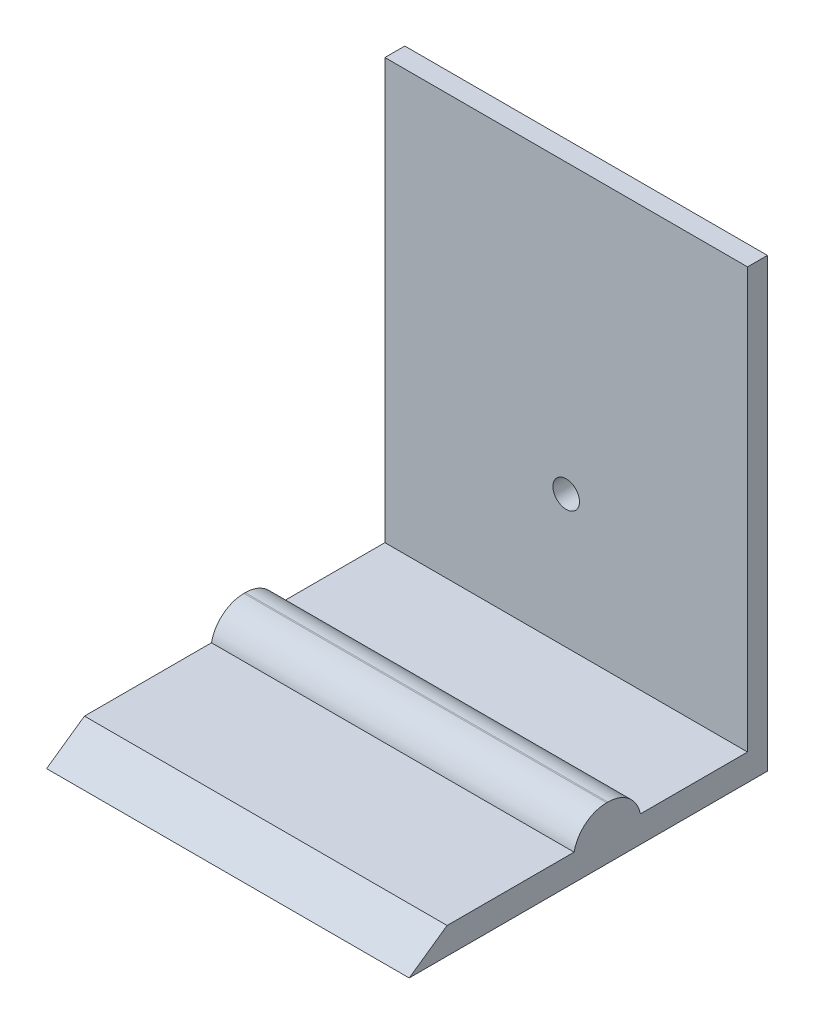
ISO-10303-21;
HEADER;
FILE_DESCRIPTION(('STEP AP214'),'2;1');
FILE_NAME('part.step','',(''),(''),'','','');
FILE_SCHEMA(('AUTOMOTIVE_DESIGN { 1 0 10303 214 1 1 1 1 }'));
ENDSEC;
DATA;
#1=APPLICATION_CONTEXT('core data for automotive mechanical design processes');
#2=APPLICATION_PROTOCOL_DEFINITION('international standard','automotive_design',2000,#1);
#3=PRODUCT_CONTEXT('',#1,'mechanical');
#4=PRODUCT('Part','Part','',(#3));
#5=PRODUCT_RELATED_PRODUCT_CATEGORY('part','',(#4));
#6=PRODUCT_DEFINITION_FORMATION('','',#4);
#7=PRODUCT_DEFINITION_CONTEXT('part definition',#1,'design');
#8=PRODUCT_DEFINITION('design','',#6,#7);
#9=PRODUCT_DEFINITION_SHAPE('','',#8);
#10=(LENGTH_UNIT() NAMED_UNIT(*) SI_UNIT(.MILLI.,.METRE.));
#11=(NAMED_UNIT(*) PLANE_ANGLE_UNIT() SI_UNIT($,.RADIAN.));
#12=(NAMED_UNIT(*) SI_UNIT($,.STERADIAN.) SOLID_ANGLE_UNIT());
#13=UNCERTAINTY_MEASURE_WITH_UNIT(LENGTH_MEASURE(1.E-05),#10,'distance_accuracy_value','');
#14=(GEOMETRIC_REPRESENTATION_CONTEXT(3) GLOBAL_UNCERTAINTY_ASSIGNED_CONTEXT((#13)) GLOBAL_UNIT_ASSIGNED_CONTEXT((#10,
#11,#12)) REPRESENTATION_CONTEXT('',''));
#15=CARTESIAN_POINT('',(0.,0.,0.));
#16=DIRECTION('',(0.,0.,1.));
#17=DIRECTION('',(1.,0.,0.));
#18=AXIS2_PLACEMENT_3D('',#15,#16,#17);
#19=CARTESIAN_POINT('',(-169.999999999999,51.,210.000000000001));
#20=DIRECTION('',(0.,-1.,0.));
#21=DIRECTION('',(0.,0.,1.));
#22=AXIS2_PLACEMENT_3D('',#19,#20,#21);
#23=PLANE('',#22);
#24=DIRECTION('',(-1.,0.,0.));
#25=VECTOR('',#24,1.);
#26=CARTESIAN_POINT('',(-44.0000000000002,51.,68.9999999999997));
#27=LINE('',#26,#25);
#28=CARTESIAN_POINT('',(-80.5000000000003,51.,68.9999999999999));
#29=VERTEX_POINT('',#28);
#30=CARTESIAN_POINT('',(-89.5000000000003,51.,69.));
#31=VERTEX_POINT('',#30);
#32=EDGE_CURVE('E11',#29,#31,#27,.T.);
#33=ORIENTED_EDGE('',*,*,#32,.F.);
#34=DIRECTION('',(0.,0.,1.));
#35=VECTOR('',#34,1.);
#36=CARTESIAN_POINT('',(-80.5000000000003,51.,59.9999999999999));
#37=LINE('',#36,#35);
#38=CARTESIAN_POINT('',(-80.5000000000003,51.,59.9999999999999));
#39=VERTEX_POINT('',#38);
#40=EDGE_CURVE('E137',#39,#29,#37,.T.);
#41=ORIENTED_EDGE('',*,*,#40,.F.);
#42=DIRECTION('',(1.,0.,0.));
#43=VECTOR('',#42,1.);
#44=CARTESIAN_POINT('',(-170.,51.,60.0000000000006));
#45=LINE('',#44,#43);
#46=CARTESIAN_POINT('',(-89.5000000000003,51.,60.));
#47=VERTEX_POINT('',#46);
#48=EDGE_CURVE('E71',#47,#39,#45,.T.);
#49=ORIENTED_EDGE('',*,*,#48,.F.);
#50=DIRECTION('',(0.,0.,1.));
#51=VECTOR('',#50,1.);
#52=CARTESIAN_POINT('',(-89.4999999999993,51.,210.));
#53=LINE('',#52,#51);
#54=EDGE_CURVE('E140',#47,#31,#53,.T.);
#55=ORIENTED_EDGE('',*,*,#54,.T.);
#56=EDGE_LOOP('',(#33,#41,#49,#55));
#57=FACE_BOUND('',#56,.T.);
#58=ADVANCED_FACE('F36',(#57),#23,.F.);
#59=CARTESIAN_POINT('',(-169.999999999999,15.,210.000000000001));
#60=DIRECTION('',(0.,1.,0.));
#61=DIRECTION('',(0.,0.,-1.));
#62=AXIS2_PLACEMENT_3D('',#59,#60,#61);
#63=PLANE('',#62);
#64=DIRECTION('',(0.,0.,-1.));
#65=VECTOR('',#64,1.);
#66=CARTESIAN_POINT('',(-43.9999999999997,15.,150.));
#67=LINE('',#66,#65);
#68=CARTESIAN_POINT('',(-44.,15.,97.7155559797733));
#69=VERTEX_POINT('',#68);
#70=CARTESIAN_POINT('',(-44.0000000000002,15.,73.4999999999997));
#71=VERTEX_POINT('',#70);
#72=EDGE_CURVE('E131',#69,#71,#67,.T.);
#73=ORIENTED_EDGE('',*,*,#72,.T.);
#74=DIRECTION('',(1.,0.,0.));
#75=VECTOR('',#74,1.);
#76=CARTESIAN_POINT('',(-44.0000000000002,15.,73.4999999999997));
#77=LINE('',#76,#75);
#78=CARTESIAN_POINT('',(-126.,15.,73.5000000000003));
#79=VERTEX_POINT('',#78);
#80=EDGE_CURVE('E214',#79,#71,#77,.T.);
#81=ORIENTED_EDGE('',*,*,#80,.F.);
#82=DIRECTION('',(0.,0.,1.));
#83=VECTOR('',#82,1.);
#84=CARTESIAN_POINT('',(-126.,15.,150.));
#85=LINE('',#84,#83);
#86=CARTESIAN_POINT('',(-126.,15.,97.7155559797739));
#87=VERTEX_POINT('',#86);
#88=EDGE_CURVE('E80',#79,#87,#85,.T.);
#89=ORIENTED_EDGE('',*,*,#88,.T.);
#90=DIRECTION('',(-1.,0.,0.));
#91=VECTOR('',#90,1.);
#92=CARTESIAN_POINT('',(-44.,15.,97.7155559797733));
#93=LINE('',#92,#91);
#94=EDGE_CURVE('E198',#69,#87,#93,.T.);
#95=ORIENTED_EDGE('',*,*,#94,.F.);
#96=EDGE_LOOP('',(#73,#81,#89,#95));
#97=FACE_BOUND('',#96,.T.);
#98=ADVANCED_FACE('F289',(#97),#63,.T.);
#99=CARTESIAN_POINT('',(-43.9999999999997,15.,150.));
#100=DIRECTION('',(-1.,0.,0.));
#101=DIRECTION('',(0.,0.,1.));
#102=AXIS2_PLACEMENT_3D('',#99,#100,#101);
#103=PLANE('',#102);
#104=ORIENTED_EDGE('',*,*,#72,.F.);
#105=CARTESIAN_POINT('',(-44.,13.5,105.064025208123));
#106=DIRECTION('',(-1.,0.,0.));
#107=DIRECTION('',(0.,0.,1.));
#108=AXIS2_PLACEMENT_3D('',#105,#106,#107);
#109=CIRCLE('',#108,7.5);
#110=CARTESIAN_POINT('',(-44.,21.,105.064025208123));
#111=VERTEX_POINT('',#110);
#112=EDGE_CURVE('E45',#69,#111,#109,.F.);
#113=ORIENTED_EDGE('',*,*,#112,.T.);
#114=DIRECTION('',(0.,0.,-1.));
#115=VECTOR('',#114,1.);
#116=CARTESIAN_POINT('',(-44.,21.,97.7155559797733));
#117=LINE('',#116,#115);
#118=CARTESIAN_POINT('',(-44.,21.,105.367086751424));
#119=VERTEX_POINT('',#118);
#120=EDGE_CURVE('E192',#119,#111,#117,.T.);
#121=ORIENTED_EDGE('',*,*,#120,.F.);
#122=CARTESIAN_POINT('',(-44.,13.5,105.367086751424));
#123=DIRECTION('',(-1.,0.,0.));
#124=DIRECTION('',(0.,0.,1.));
#125=AXIS2_PLACEMENT_3D('',#122,#123,#124);
#126=CIRCLE('',#125,7.5);
#127=CARTESIAN_POINT('',(-43.9999999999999,15.,112.715555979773));
#128=VERTEX_POINT('',#127);
#129=EDGE_CURVE('E156',#119,#128,#126,.F.);
#130=ORIENTED_EDGE('',*,*,#129,.T.);
#131=CARTESIAN_POINT('',(-43.9999999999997,15.,141.431111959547));
#132=VERTEX_POINT('',#131);
#133=EDGE_CURVE('E195',#132,#128,#67,.T.);
#134=ORIENTED_EDGE('',*,*,#133,.F.);
#135=DIRECTION('',(0.,-0.573576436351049,0.81915204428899));
#136=VECTOR('',#135,1.);
#137=CARTESIAN_POINT('',(-43.9999999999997,15.,141.431111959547));
#138=LINE('',#137,#136);
#139=CARTESIAN_POINT('',(-43.9999999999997,9.00000000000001,150.));
#140=VERTEX_POINT('',#139);
#141=EDGE_CURVE('E171',#132,#140,#138,.T.);
#142=ORIENTED_EDGE('',*,*,#141,.T.);
#143=DIRECTION('',(0.,0.,-1.));
#144=VECTOR('',#143,1.);
#145=CARTESIAN_POINT('',(-43.9999999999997,9.00000000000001,150.));
#146=LINE('',#145,#144);
#147=CARTESIAN_POINT('',(-44.0000000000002,9.00000000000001,68.9999999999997));
#148=VERTEX_POINT('',#147);
#149=EDGE_CURVE('E189',#140,#148,#146,.T.);
#150=ORIENTED_EDGE('',*,*,#149,.T.);
#151=DIRECTION('',(0.,-1.,0.));
#152=VECTOR('',#151,1.);
#153=CARTESIAN_POINT('',(-44.0000000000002,15.,68.9999999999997));
#154=LINE('',#153,#152);
#155=CARTESIAN_POINT('',(-44.0000000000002,110.,68.9999999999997));
#156=VERTEX_POINT('',#155);
#157=EDGE_CURVE('E176',#156,#148,#154,.T.);
#158=ORIENTED_EDGE('',*,*,#157,.F.);
#159=DIRECTION('',(0.,0.,-1.));
#160=VECTOR('',#159,1.);
#161=CARTESIAN_POINT('',(-44.0000000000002,110.,73.4999999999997));
#162=LINE('',#161,#160);
#163=CARTESIAN_POINT('',(-44.0000000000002,110.,73.4999999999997));
#164=VERTEX_POINT('',#163);
#165=EDGE_CURVE('E237',#164,#156,#162,.T.);
#166=ORIENTED_EDGE('',*,*,#165,.F.);
#167=DIRECTION('',(0.,-1.,0.));
#168=VECTOR('',#167,1.);
#169=CARTESIAN_POINT('',(-44.0000000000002,45.,73.4999999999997));
#170=LINE('',#169,#168);
#171=EDGE_CURVE('E211',#164,#71,#170,.T.);
#172=ORIENTED_EDGE('',*,*,#171,.T.);
#173=EDGE_LOOP('',(#104,#113,#121,#130,#134,#142,#150,#158,#166,#172));
#174=FACE_BOUND('',#173,.T.);
#175=ADVANCED_FACE('F255',(#174),#103,.F.);
#176=CARTESIAN_POINT('',(-44.0000000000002,15.,68.9999999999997));
#177=DIRECTION('',(0.,0.,1.));
#178=DIRECTION('',(1.,0.,0.));
#179=AXIS2_PLACEMENT_3D('',#176,#177,#178);
#180=PLANE('',#179);
#181=DIRECTION('',(0.,-1.,0.));
#182=VECTOR('',#181,1.);
#183=CARTESIAN_POINT('',(-80.5000000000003,29.5,68.9999999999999));
#184=LINE('',#183,#182);
#185=CARTESIAN_POINT('',(-80.5000000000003,29.5,68.9999999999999));
#186=VERTEX_POINT('',#185);
#187=EDGE_CURVE('E142',#29,#186,#184,.T.);
#188=ORIENTED_EDGE('',*,*,#187,.F.);
#189=ORIENTED_EDGE('',*,*,#32,.T.);
#190=DIRECTION('',(0.,1.,0.));
#191=VECTOR('',#190,1.);
#192=CARTESIAN_POINT('',(-89.5000000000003,45.,69.));
#193=LINE('',#192,#191);
#194=CARTESIAN_POINT('',(-89.5000000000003,29.5,69.));
#195=VERTEX_POINT('',#194);
#196=EDGE_CURVE('E220',#195,#31,#193,.T.);
#197=ORIENTED_EDGE('',*,*,#196,.F.);
#198=CARTESIAN_POINT('',(-85.0000000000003,29.5,69.));
#199=DIRECTION('',(0.,0.,-1.));
#200=DIRECTION('',(-1.,0.,0.));
#201=AXIS2_PLACEMENT_3D('',#198,#199,#200);
#202=CIRCLE('',#201,4.5);
#203=EDGE_CURVE('E54',#186,#195,#202,.T.);
#204=ORIENTED_EDGE('',*,*,#203,.F.);
#205=EDGE_LOOP('',(#188,#189,#197,#204));
#206=FACE_BOUND('',#205,.T.);
#207=DIRECTION('',(-1.,0.,0.));
#208=VECTOR('',#207,1.);
#209=CARTESIAN_POINT('',(-44.0000000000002,110.,68.9999999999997));
#210=LINE('',#209,#208);
#211=CARTESIAN_POINT('',(-126.,110.,69.0000000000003));
#212=VERTEX_POINT('',#211);
#213=EDGE_CURVE('E234',#156,#212,#210,.T.);
#214=ORIENTED_EDGE('',*,*,#213,.F.);
#215=ORIENTED_EDGE('',*,*,#157,.T.);
#216=DIRECTION('',(-1.,0.,0.));
#217=VECTOR('',#216,1.);
#218=CARTESIAN_POINT('',(-44.0000000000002,9.00000000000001,68.9999999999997));
#219=LINE('',#218,#217);
#220=CARTESIAN_POINT('',(-126.,9.00000000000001,69.0000000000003));
#221=VERTEX_POINT('',#220);
#222=EDGE_CURVE('E187',#148,#221,#219,.T.);
#223=ORIENTED_EDGE('',*,*,#222,.T.);
#224=DIRECTION('',(0.,-1.,0.));
#225=VECTOR('',#224,1.);
#226=CARTESIAN_POINT('',(-126.,15.,69.0000000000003));
#227=LINE('',#226,#225);
#228=EDGE_CURVE('E179',#212,#221,#227,.T.);
#229=ORIENTED_EDGE('',*,*,#228,.F.);
#230=EDGE_LOOP('',(#214,#215,#223,#229));
#231=FACE_BOUND('',#230,.T.);
#232=ADVANCED_FACE('F143',(#206,#231),#180,.F.);
#233=CARTESIAN_POINT('',(-126.,15.,150.));
#234=DIRECTION('',(1.,0.,0.));
#235=DIRECTION('',(0.,0.,-1.));
#236=AXIS2_PLACEMENT_3D('',#233,#234,#235);
#237=PLANE('',#236);
#238=DIRECTION('',(0.,0.,1.));
#239=VECTOR('',#238,1.);
#240=CARTESIAN_POINT('',(-126.,21.,97.7155559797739));
#241=LINE('',#240,#239);
#242=CARTESIAN_POINT('',(-126.,21.,105.064025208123));
#243=VERTEX_POINT('',#242);
#244=CARTESIAN_POINT('',(-126.,21.,105.367086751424));
#245=VERTEX_POINT('',#244);
#246=EDGE_CURVE('E201',#243,#245,#241,.T.);
#247=ORIENTED_EDGE('',*,*,#246,.F.);
#248=CARTESIAN_POINT('',(-126.,13.5,105.064025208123));
#249=DIRECTION('',(1.,0.,0.));
#250=DIRECTION('',(0.,0.,-1.));
#251=AXIS2_PLACEMENT_3D('',#248,#249,#250);
#252=CIRCLE('',#251,7.5);
#253=EDGE_CURVE('E158',#243,#87,#252,.F.);
#254=ORIENTED_EDGE('',*,*,#253,.T.);
#255=ORIENTED_EDGE('',*,*,#88,.F.);
#256=DIRECTION('',(0.,-1.,0.));
#257=VECTOR('',#256,1.);
#258=CARTESIAN_POINT('',(-126.,45.,73.5000000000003));
#259=LINE('',#258,#257);
#260=CARTESIAN_POINT('',(-126.,110.,73.5000000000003));
#261=VERTEX_POINT('',#260);
#262=EDGE_CURVE('E205',#261,#79,#259,.T.);
#263=ORIENTED_EDGE('',*,*,#262,.F.);
#264=DIRECTION('',(0.,0.,1.));
#265=VECTOR('',#264,1.);
#266=CARTESIAN_POINT('',(-126.,110.,73.5000000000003));
#267=LINE('',#266,#265);
#268=EDGE_CURVE('E231',#212,#261,#267,.T.);
#269=ORIENTED_EDGE('',*,*,#268,.F.);
#270=ORIENTED_EDGE('',*,*,#228,.T.);
#271=DIRECTION('',(0.,0.,1.));
#272=VECTOR('',#271,1.);
#273=CARTESIAN_POINT('',(-126.,9.00000000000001,150.));
#274=LINE('',#273,#272);
#275=CARTESIAN_POINT('',(-126.,9.00000000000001,150.));
#276=VERTEX_POINT('',#275);
#277=EDGE_CURVE('E185',#221,#276,#274,.T.);
#278=ORIENTED_EDGE('',*,*,#277,.T.);
#279=DIRECTION('',(0.,0.573576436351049,-0.81915204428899));
#280=VECTOR('',#279,1.);
#281=CARTESIAN_POINT('',(-126.,15.,141.431111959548));
#282=LINE('',#281,#280);
#283=CARTESIAN_POINT('',(-126.,15.,141.431111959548));
#284=VERTEX_POINT('',#283);
#285=EDGE_CURVE('E168',#276,#284,#282,.T.);
#286=ORIENTED_EDGE('',*,*,#285,.T.);
#287=CARTESIAN_POINT('',(-126.,15.,112.715555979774));
#288=VERTEX_POINT('',#287);
#289=EDGE_CURVE('E194',#288,#284,#85,.T.);
#290=ORIENTED_EDGE('',*,*,#289,.F.);
#291=CARTESIAN_POINT('',(-126.,13.5,105.367086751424));
#292=DIRECTION('',(1.,0.,0.));
#293=DIRECTION('',(0.,0.,-1.));
#294=AXIS2_PLACEMENT_3D('',#291,#292,#293);
#295=CIRCLE('',#294,7.5);
#296=EDGE_CURVE('E160',#288,#245,#295,.F.);
#297=ORIENTED_EDGE('',*,*,#296,.T.);
#298=EDGE_LOOP('',(#247,#254,#255,#263,#269,#270,#278,#286,#290,#297));
#299=FACE_BOUND('',#298,.T.);
#300=ADVANCED_FACE('F303',(#299),#237,.F.);
#301=DIRECTION('',(1.,0.,0.));
#302=VECTOR('',#301,1.);
#303=CARTESIAN_POINT('',(-43.9999999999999,15.,112.715555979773));
#304=LINE('',#303,#302);
#305=EDGE_CURVE('E202',#288,#128,#304,.T.);
#306=ORIENTED_EDGE('',*,*,#305,.F.);
#307=ORIENTED_EDGE('',*,*,#289,.T.);
#308=DIRECTION('',(1.,0.,0.));
#309=VECTOR('',#308,1.);
#310=CARTESIAN_POINT('',(-43.9999999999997,15.,141.431111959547));
#311=LINE('',#310,#309);
#312=EDGE_CURVE('E173',#284,#132,#311,.T.);
#313=ORIENTED_EDGE('',*,*,#312,.T.);
#314=ORIENTED_EDGE('',*,*,#133,.T.);
#315=EDGE_LOOP('',(#306,#307,#313,#314));
#316=FACE_BOUND('',#315,.T.);
#317=ADVANCED_FACE('F294',(#316),#63,.T.);
#318=CARTESIAN_POINT('',(-169.999999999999,9.00000000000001,210.000000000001));
#319=DIRECTION('',(0.,1.,0.));
#320=DIRECTION('',(0.,0.,-1.));
#321=AXIS2_PLACEMENT_3D('',#318,#319,#320);
#322=PLANE('',#321);
#323=ORIENTED_EDGE('',*,*,#149,.F.);
#324=DIRECTION('',(1.,0.,0.));
#325=VECTOR('',#324,1.);
#326=CARTESIAN_POINT('',(-43.9999999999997,9.00000000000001,150.));
#327=LINE('',#326,#325);
#328=EDGE_CURVE('E182',#276,#140,#327,.T.);
#329=ORIENTED_EDGE('',*,*,#328,.F.);
#330=ORIENTED_EDGE('',*,*,#277,.F.);
#331=ORIENTED_EDGE('',*,*,#222,.F.);
#332=EDGE_LOOP('',(#323,#329,#330,#331));
#333=FACE_BOUND('',#332,.T.);
#334=ADVANCED_FACE('F302',(#333),#322,.F.);
#335=CARTESIAN_POINT('',(-170.,15.,141.431111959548));
#336=DIRECTION('',(0.,0.81915204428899,0.573576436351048));
#337=DIRECTION('',(-1.,0.,0.));
#338=AXIS2_PLACEMENT_3D('',#335,#336,#337);
#339=PLANE('',#338);
#340=ORIENTED_EDGE('',*,*,#285,.F.);
#341=ORIENTED_EDGE('',*,*,#328,.T.);
#342=ORIENTED_EDGE('',*,*,#141,.F.);
#343=ORIENTED_EDGE('',*,*,#312,.F.);
#344=EDGE_LOOP('',(#340,#341,#342,#343));
#345=FACE_BOUND('',#344,.T.);
#346=ADVANCED_FACE('F309',(#345),#339,.T.);
#347=CARTESIAN_POINT('',(-169.999999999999,21.,210.000000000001));
#348=DIRECTION('',(0.,-1.,0.));
#349=DIRECTION('',(0.,0.,1.));
#350=AXIS2_PLACEMENT_3D('',#347,#348,#349);
#351=PLANE('',#350);
#352=ORIENTED_EDGE('',*,*,#120,.T.);
#353=DIRECTION('',(-1.,0.,0.));
#354=VECTOR('',#353,1.);
#355=CARTESIAN_POINT('',(-170.,21.,105.064025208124));
#356=LINE('',#355,#354);
#357=EDGE_CURVE('E162',#111,#243,#356,.T.);
#358=ORIENTED_EDGE('',*,*,#357,.T.);
#359=ORIENTED_EDGE('',*,*,#246,.T.);
#360=DIRECTION('',(1.,0.,0.));
#361=VECTOR('',#360,1.);
#362=CARTESIAN_POINT('',(-170.,21.,105.367086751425));
#363=LINE('',#362,#361);
#364=EDGE_CURVE('E165',#245,#119,#363,.T.);
#365=ORIENTED_EDGE('',*,*,#364,.T.);
#366=EDGE_LOOP('',(#352,#358,#359,#365));
#367=FACE_BOUND('',#366,.T.);
#368=ADVANCED_FACE('F321',(#367),#351,.F.);
#369=CARTESIAN_POINT('',(-44.,13.5,105.064025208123));
#370=DIRECTION('',(-1.,0.,0.));
#371=DIRECTION('',(0.,0.,1.));
#372=AXIS2_PLACEMENT_3D('',#369,#370,#371);
#373=CYLINDRICAL_SURFACE('',#372,7.5);
#374=ORIENTED_EDGE('',*,*,#112,.F.);
#375=ORIENTED_EDGE('',*,*,#94,.T.);
#376=ORIENTED_EDGE('',*,*,#253,.F.);
#377=ORIENTED_EDGE('',*,*,#357,.F.);
#378=EDGE_LOOP('',(#374,#375,#376,#377));
#379=FACE_BOUND('',#378,.T.);
#380=ADVANCED_FACE('F332',(#379),#373,.T.);
#381=CARTESIAN_POINT('',(-44.,13.5,105.367086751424));
#382=DIRECTION('',(1.,0.,0.));
#383=DIRECTION('',(0.,0.,-1.));
#384=AXIS2_PLACEMENT_3D('',#381,#382,#383);
#385=CYLINDRICAL_SURFACE('',#384,7.5);
#386=ORIENTED_EDGE('',*,*,#296,.F.);
#387=ORIENTED_EDGE('',*,*,#305,.T.);
#388=ORIENTED_EDGE('',*,*,#129,.F.);
#389=ORIENTED_EDGE('',*,*,#364,.F.);
#390=EDGE_LOOP('',(#386,#387,#388,#389));
#391=FACE_BOUND('',#390,.T.);
#392=ADVANCED_FACE('F249',(#391),#385,.T.);
#393=CARTESIAN_POINT('',(-44.0000000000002,45.,73.4999999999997));
#394=DIRECTION('',(0.,0.,-1.));
#395=DIRECTION('',(-1.,0.,0.));
#396=AXIS2_PLACEMENT_3D('',#393,#394,#395);
#397=PLANE('',#396);
#398=CARTESIAN_POINT('',(-85.0000000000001,45.0000000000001,73.5));
#399=DIRECTION('',(0.,0.,-1.));
#400=DIRECTION('',(-1.,0.,0.));
#401=AXIS2_PLACEMENT_3D('',#398,#399,#400);
#402=CIRCLE('',#401,3.00000000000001);
#403=CARTESIAN_POINT('',(-88.0000000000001,45.0000000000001,73.5));
#404=VERTEX_POINT('',#403);
#405=EDGE_CURVE('E240',#404,#404,#402,.F.);
#406=ORIENTED_EDGE('',*,*,#405,.F.);
#407=EDGE_LOOP('',(#406));
#408=FACE_BOUND('',#407,.T.);
#409=ORIENTED_EDGE('',*,*,#80,.T.);
#410=ORIENTED_EDGE('',*,*,#171,.F.);
#411=DIRECTION('',(1.,0.,0.));
#412=VECTOR('',#411,1.);
#413=CARTESIAN_POINT('',(-44.0000000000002,110.,73.4999999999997));
#414=LINE('',#413,#412);
#415=EDGE_CURVE('E228',#261,#164,#414,.T.);
#416=ORIENTED_EDGE('',*,*,#415,.F.);
#417=ORIENTED_EDGE('',*,*,#262,.T.);
#418=EDGE_LOOP('',(#409,#410,#416,#417));
#419=FACE_BOUND('',#418,.T.);
#420=ADVANCED_FACE('F246',(#408,#419),#397,.F.);
#421=CARTESIAN_POINT('',(-80.5000000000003,29.5,59.9999999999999));
#422=DIRECTION('',(-1.,0.,0.));
#423=DIRECTION('',(0.,0.,1.));
#424=AXIS2_PLACEMENT_3D('',#421,#422,#423);
#425=PLANE('',#424);
#426=ORIENTED_EDGE('',*,*,#187,.T.);
#427=DIRECTION('',(0.,0.,1.));
#428=VECTOR('',#427,1.);
#429=CARTESIAN_POINT('',(-80.5000000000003,29.5,59.9999999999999));
#430=LINE('',#429,#428);
#431=CARTESIAN_POINT('',(-80.5000000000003,29.5,59.9999999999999));
#432=VERTEX_POINT('',#431);
#433=EDGE_CURVE('E216',#432,#186,#430,.T.);
#434=ORIENTED_EDGE('',*,*,#433,.F.);
#435=DIRECTION('',(0.,-1.,0.));
#436=VECTOR('',#435,1.);
#437=CARTESIAN_POINT('',(-80.5000000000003,29.5,59.9999999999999));
#438=LINE('',#437,#436);
#439=EDGE_CURVE('E149',#39,#432,#438,.T.);
#440=ORIENTED_EDGE('',*,*,#439,.F.);
#441=ORIENTED_EDGE('',*,*,#40,.T.);
#442=EDGE_LOOP('',(#426,#434,#440,#441));
#443=FACE_BOUND('',#442,.T.);
#444=ADVANCED_FACE('F148',(#443),#425,.F.);
#445=CARTESIAN_POINT('',(-85.0000000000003,29.5,60.));
#446=DIRECTION('',(0.,0.,1.));
#447=DIRECTION('',(1.,0.,0.));
#448=AXIS2_PLACEMENT_3D('',#445,#446,#447);
#449=CYLINDRICAL_SURFACE('',#448,4.5);
#450=ORIENTED_EDGE('',*,*,#203,.T.);
#451=DIRECTION('',(0.,0.,1.));
#452=VECTOR('',#451,1.);
#453=CARTESIAN_POINT('',(-89.5000000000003,29.5,60.));
#454=LINE('',#453,#452);
#455=CARTESIAN_POINT('',(-89.5000000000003,29.5,60.));
#456=VERTEX_POINT('',#455);
#457=EDGE_CURVE('E150',#456,#195,#454,.T.);
#458=ORIENTED_EDGE('',*,*,#457,.F.);
#459=CARTESIAN_POINT('',(-85.0000000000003,29.5,60.));
#460=DIRECTION('',(0.,0.,-1.));
#461=DIRECTION('',(-1.,0.,0.));
#462=AXIS2_PLACEMENT_3D('',#459,#460,#461);
#463=CIRCLE('',#462,4.5);
#464=EDGE_CURVE('E224',#432,#456,#463,.T.);
#465=ORIENTED_EDGE('',*,*,#464,.F.);
#466=ORIENTED_EDGE('',*,*,#433,.T.);
#467=EDGE_LOOP('',(#450,#458,#465,#466));
#468=FACE_BOUND('',#467,.T.);
#469=ADVANCED_FACE('F276',(#468),#449,.T.);
#470=CARTESIAN_POINT('',(-89.5000000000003,45.,60.));
#471=DIRECTION('',(1.,0.,0.));
#472=DIRECTION('',(0.,0.,-1.));
#473=AXIS2_PLACEMENT_3D('',#470,#471,#472);
#474=PLANE('',#473);
#475=ORIENTED_EDGE('',*,*,#196,.T.);
#476=ORIENTED_EDGE('',*,*,#54,.F.);
#477=DIRECTION('',(0.,1.,0.));
#478=VECTOR('',#477,1.);
#479=CARTESIAN_POINT('',(-89.5000000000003,45.,60.));
#480=LINE('',#479,#478);
#481=EDGE_CURVE('E152',#456,#47,#480,.T.);
#482=ORIENTED_EDGE('',*,*,#481,.F.);
#483=ORIENTED_EDGE('',*,*,#457,.T.);
#484=EDGE_LOOP('',(#475,#476,#482,#483));
#485=FACE_BOUND('',#484,.T.);
#486=ADVANCED_FACE('F278',(#485),#474,.F.);
#487=CARTESIAN_POINT('',(-85.0000000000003,29.5,60.));
#488=DIRECTION('',(0.,0.,-1.));
#489=DIRECTION('',(-1.,0.,0.));
#490=AXIS2_PLACEMENT_3D('',#487,#488,#489);
#491=PLANE('',#490);
#492=CARTESIAN_POINT('',(-85.0000000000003,45.,60.));
#493=DIRECTION('',(0.,0.,-1.));
#494=DIRECTION('',(-1.,0.,0.));
#495=AXIS2_PLACEMENT_3D('',#492,#493,#494);
#496=CIRCLE('',#495,3.00000000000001);
#497=CARTESIAN_POINT('',(-88.0000000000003,45.,60.));
#498=VERTEX_POINT('',#497);
#499=EDGE_CURVE('E39',#498,#498,#496,.F.);
#500=ORIENTED_EDGE('',*,*,#499,.T.);
#501=EDGE_LOOP('',(#500));
#502=FACE_BOUND('',#501,.T.);
#503=ORIENTED_EDGE('',*,*,#439,.T.);
#504=ORIENTED_EDGE('',*,*,#464,.T.);
#505=ORIENTED_EDGE('',*,*,#481,.T.);
#506=ORIENTED_EDGE('',*,*,#48,.T.);
#507=EDGE_LOOP('',(#503,#504,#505,#506));
#508=FACE_BOUND('',#507,.T.);
#509=ADVANCED_FACE('F273',(#502,#508),#491,.T.);
#510=CARTESIAN_POINT('',(-85.0000000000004,45.,50.5));
#511=DIRECTION('',(0.,0.,1.));
#512=DIRECTION('',(1.,0.,0.));
#513=AXIS2_PLACEMENT_3D('',#510,#511,#512);
#514=CYLINDRICAL_SURFACE('',#513,3.00000000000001);
#515=ORIENTED_EDGE('',*,*,#499,.F.);
#516=EDGE_LOOP('',(#515));
#517=FACE_BOUND('',#516,.T.);
#518=ORIENTED_EDGE('',*,*,#405,.T.);
#519=EDGE_LOOP('',(#518));
#520=FACE_BOUND('',#519,.T.);
#521=ADVANCED_FACE('F244',(#517,#520),#514,.F.);
#522=CARTESIAN_POINT('',(-169.999999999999,110.,210.000000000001));
#523=DIRECTION('',(0.,1.,0.));
#524=DIRECTION('',(0.,0.,-1.));
#525=AXIS2_PLACEMENT_3D('',#522,#523,#524);
#526=PLANE('',#525);
#527=ORIENTED_EDGE('',*,*,#165,.T.);
#528=ORIENTED_EDGE('',*,*,#213,.T.);
#529=ORIENTED_EDGE('',*,*,#268,.T.);
#530=ORIENTED_EDGE('',*,*,#415,.T.);
#531=EDGE_LOOP('',(#527,#528,#529,#530));
#532=FACE_BOUND('',#531,.T.);
#533=ADVANCED_FACE('F262',(#532),#526,.T.);
#534=CLOSED_SHELL('',(#58,#98,#175,#232,#300,#317,#334,#346,#368,#380,#392,#420,#444,#469,#486,
#509,#521,#533));
#535=MANIFOLD_SOLID_BREP('B2',#534);
#536=ADVANCED_BREP_SHAPE_REPRESENTATION('',(#18,#535),#14);
#537=SHAPE_DEFINITION_REPRESENTATION(#9,#536);
ENDSEC;
END-ISO-10303-21;
